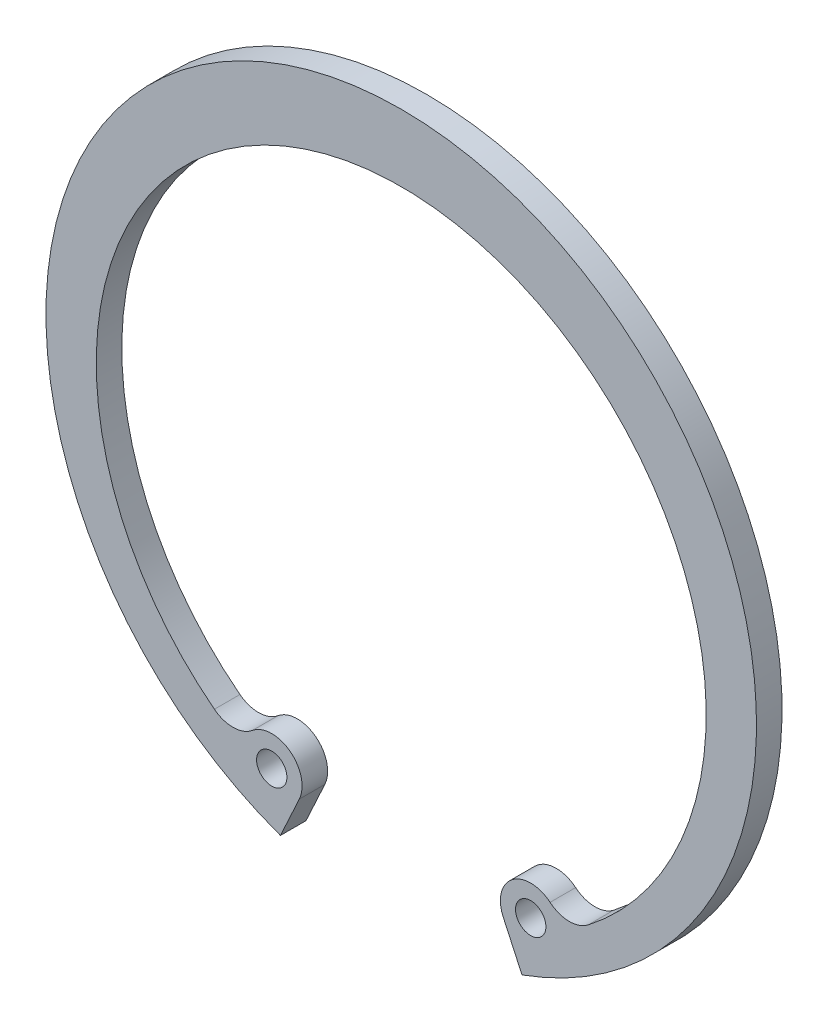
ISO-10303-21;
HEADER;
FILE_DESCRIPTION(('STEP AP214'),'2;1');
FILE_NAME('part.step','',(''),(''),'','','');
FILE_SCHEMA(('AUTOMOTIVE_DESIGN { 1 0 10303 214 1 1 1 1 }'));
ENDSEC;
DATA;
#1=APPLICATION_CONTEXT('core data for automotive mechanical design processes');
#2=APPLICATION_PROTOCOL_DEFINITION('international standard','automotive_design',2000,#1);
#3=PRODUCT_CONTEXT('',#1,'mechanical');
#4=PRODUCT('Part','Part','',(#3));
#5=PRODUCT_RELATED_PRODUCT_CATEGORY('part','',(#4));
#6=PRODUCT_DEFINITION_FORMATION('','',#4);
#7=PRODUCT_DEFINITION_CONTEXT('part definition',#1,'design');
#8=PRODUCT_DEFINITION('design','',#6,#7);
#9=PRODUCT_DEFINITION_SHAPE('','',#8);
#10=(LENGTH_UNIT() NAMED_UNIT(*) SI_UNIT(.MILLI.,.METRE.));
#11=(NAMED_UNIT(*) PLANE_ANGLE_UNIT() SI_UNIT($,.RADIAN.));
#12=(NAMED_UNIT(*) SI_UNIT($,.STERADIAN.) SOLID_ANGLE_UNIT());
#13=UNCERTAINTY_MEASURE_WITH_UNIT(LENGTH_MEASURE(1.E-05),#10,'distance_accuracy_value','');
#14=(GEOMETRIC_REPRESENTATION_CONTEXT(3) GLOBAL_UNCERTAINTY_ASSIGNED_CONTEXT((#13)) GLOBAL_UNIT_ASSIGNED_CONTEXT((#10,
#11,#12)) REPRESENTATION_CONTEXT('',''));
#15=CARTESIAN_POINT('',(0.,0.,0.));
#16=DIRECTION('',(0.,0.,1.));
#17=DIRECTION('',(1.,0.,0.));
#18=AXIS2_PLACEMENT_3D('',#15,#16,#17);
#19=CARTESIAN_POINT('',(-0.048388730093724,-19.9071120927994,0.));
#20=DIRECTION('',(0.,0.,1.));
#21=DIRECTION('',(1.,0.,0.));
#22=AXIS2_PLACEMENT_3D('',#19,#20,#21);
#23=PLANE('',#22);
#24=CARTESIAN_POINT('',(-8.10888999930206,-37.5689613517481,0.));
#25=DIRECTION('',(0.,0.,1.));
#26=DIRECTION('',(1.,0.,0.));
#27=AXIS2_PLACEMENT_3D('',#24,#25,#26);
#28=CIRCLE('',#27,0.95);
#29=CARTESIAN_POINT('',(-7.15888999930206,-37.5689613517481,0.));
#30=VERTEX_POINT('',#29);
#31=EDGE_CURVE('E130',#30,#30,#28,.T.);
#32=ORIENTED_EDGE('',*,*,#31,.T.);
#33=EDGE_LOOP('',(#32));
#34=FACE_BOUND('',#33,.T.);
#35=CARTESIAN_POINT('',(8.10888999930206,-37.5689613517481,0.));
#36=DIRECTION('',(0.,0.,1.));
#37=DIRECTION('',(1.,0.,0.));
#38=AXIS2_PLACEMENT_3D('',#35,#36,#37);
#39=CIRCLE('',#38,0.95);
#40=CARTESIAN_POINT('',(9.05888999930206,-37.5689613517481,0.));
#41=VERTEX_POINT('',#40);
#42=EDGE_CURVE('E133',#41,#41,#39,.T.);
#43=ORIENTED_EDGE('',*,*,#42,.T.);
#44=EDGE_LOOP('',(#43));
#45=FACE_BOUND('',#44,.T.);
#46=CARTESIAN_POINT('',(-10.536154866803,-34.6451991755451,0.));
#47=DIRECTION('',(0.,0.,1.));
#48=DIRECTION('',(1.,0.,0.));
#49=AXIS2_PLACEMENT_3D('',#46,#47,#48);
#50=CIRCLE('',#49,1.9);
#51=CARTESIAN_POINT('',(-11.7000324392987,-36.1469944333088,0.));
#52=VERTEX_POINT('',#51);
#53=CARTESIAN_POINT('',(-9.32252243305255,-36.1070802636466,0.));
#54=VERTEX_POINT('',#53);
#55=EDGE_CURVE('E136',#52,#54,#50,.T.);
#56=ORIENTED_EDGE('',*,*,#55,.T.);
#57=CARTESIAN_POINT('',(-8.10888999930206,-37.5689613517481,0.));
#58=DIRECTION('',(0.,0.,1.));
#59=DIRECTION('',(1.,0.,0.));
#60=AXIS2_PLACEMENT_3D('',#57,#58,#59);
#61=CIRCLE('',#60,1.9);
#62=CARTESIAN_POINT('',(-6.38377234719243,-38.3651831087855,0.));
#63=VERTEX_POINT('',#62);
#64=EDGE_CURVE('E138',#63,#54,#61,.T.);
#65=ORIENTED_EDGE('',*,*,#64,.F.);
#66=DIRECTION('',(0.419064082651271,0.90795665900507,0.));
#67=VECTOR('',#66,1.);
#68=CARTESIAN_POINT('',(-6.38377234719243,-38.3651831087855,0.));
#69=LINE('',#68,#67);
#70=CARTESIAN_POINT('',(-7.565,-40.9244659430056,0.));
#71=VERTEX_POINT('',#70);
#72=EDGE_CURVE('E103',#71,#63,#69,.T.);
#73=ORIENTED_EDGE('',*,*,#72,.F.);
#74=CARTESIAN_POINT('',(0.,-20.,0.));
#75=DIRECTION('',(0.,0.,1.));
#76=DIRECTION('',(1.,0.,0.));
#77=AXIS2_PLACEMENT_3D('',#74,#75,#76);
#78=CIRCLE('',#77,22.25);
#79=CARTESIAN_POINT('',(7.565,-40.9244659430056,0.));
#80=VERTEX_POINT('',#79);
#81=EDGE_CURVE('E140',#80,#71,#78,.T.);
#82=ORIENTED_EDGE('',*,*,#81,.F.);
#83=DIRECTION('',(0.419064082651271,-0.90795665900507,0.));
#84=VECTOR('',#83,1.);
#85=CARTESIAN_POINT('',(7.565,-40.9244659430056,0.));
#86=LINE('',#85,#84);
#87=CARTESIAN_POINT('',(6.38377234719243,-38.3651831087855,0.));
#88=VERTEX_POINT('',#87);
#89=EDGE_CURVE('E107',#88,#80,#86,.T.);
#90=ORIENTED_EDGE('',*,*,#89,.F.);
#91=CARTESIAN_POINT('',(8.10888999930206,-37.5689613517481,0.));
#92=DIRECTION('',(0.,0.,1.));
#93=DIRECTION('',(1.,0.,0.));
#94=AXIS2_PLACEMENT_3D('',#91,#92,#93);
#95=CIRCLE('',#94,1.9);
#96=CARTESIAN_POINT('',(9.32252243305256,-36.1070802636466,0.));
#97=VERTEX_POINT('',#96);
#98=EDGE_CURVE('E83',#97,#88,#95,.T.);
#99=ORIENTED_EDGE('',*,*,#98,.F.);
#100=CARTESIAN_POINT('',(10.536154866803,-34.6451991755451,0.));
#101=DIRECTION('',(0.,0.,1.));
#102=DIRECTION('',(1.,0.,0.));
#103=AXIS2_PLACEMENT_3D('',#100,#101,#102);
#104=CIRCLE('',#103,1.9);
#105=CARTESIAN_POINT('',(11.7000324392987,-36.1469944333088,0.));
#106=VERTEX_POINT('',#105);
#107=EDGE_CURVE('E79',#97,#106,#104,.T.);
#108=ORIENTED_EDGE('',*,*,#107,.T.);
#109=CARTESIAN_POINT('',(0.,-21.05,0.));
#110=DIRECTION('',(0.,0.,1.));
#111=DIRECTION('',(1.,0.,0.));
#112=AXIS2_PLACEMENT_3D('',#109,#110,#111);
#113=CIRCLE('',#112,19.1);
#114=EDGE_CURVE('E19',#106,#52,#113,.T.);
#115=ORIENTED_EDGE('',*,*,#114,.T.);
#116=EDGE_LOOP('',(#56,#65,#73,#82,#90,#99,#108,#115));
#117=FACE_BOUND('',#116,.T.);
#118=ADVANCED_FACE('F16',(#34,#45,#117),#23,.F.);
#119=CARTESIAN_POINT('',(0.,-21.05,0.));
#120=DIRECTION('',(0.,0.,1.));
#121=DIRECTION('',(1.,0.,0.));
#122=AXIS2_PLACEMENT_3D('',#119,#120,#121);
#123=CYLINDRICAL_SURFACE('',#122,19.1);
#124=DIRECTION('',(0.,0.,1.));
#125=VECTOR('',#124,1.);
#126=CARTESIAN_POINT('',(-11.7000324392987,-36.1469944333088,0.));
#127=LINE('',#126,#125);
#128=CARTESIAN_POINT('',(-11.7000324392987,-36.1469944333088,1.6));
#129=VERTEX_POINT('',#128);
#130=EDGE_CURVE('E92',#129,#52,#127,.F.);
#131=ORIENTED_EDGE('',*,*,#130,.T.);
#132=ORIENTED_EDGE('',*,*,#114,.F.);
#133=DIRECTION('',(0.,0.,1.));
#134=VECTOR('',#133,1.);
#135=CARTESIAN_POINT('',(11.7000324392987,-36.1469944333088,0.));
#136=LINE('',#135,#134);
#137=CARTESIAN_POINT('',(11.7000324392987,-36.1469944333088,1.6));
#138=VERTEX_POINT('',#137);
#139=EDGE_CURVE('E87',#106,#138,#136,.T.);
#140=ORIENTED_EDGE('',*,*,#139,.T.);
#141=CARTESIAN_POINT('',(0.,-21.05,1.6));
#142=DIRECTION('',(0.,0.,1.));
#143=DIRECTION('',(1.,0.,0.));
#144=AXIS2_PLACEMENT_3D('',#141,#142,#143);
#145=CIRCLE('',#144,19.1);
#146=EDGE_CURVE('E128',#129,#138,#145,.F.);
#147=ORIENTED_EDGE('',*,*,#146,.F.);
#148=EDGE_LOOP('',(#131,#132,#140,#147));
#149=FACE_BOUND('',#148,.T.);
#150=ADVANCED_FACE('F89',(#149),#123,.F.);
#151=CARTESIAN_POINT('',(10.536154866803,-34.6451991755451,0.));
#152=DIRECTION('',(0.,0.,1.));
#153=DIRECTION('',(1.,0.,0.));
#154=AXIS2_PLACEMENT_3D('',#151,#152,#153);
#155=CYLINDRICAL_SURFACE('',#154,1.9);
#156=ORIENTED_EDGE('',*,*,#139,.F.);
#157=ORIENTED_EDGE('',*,*,#107,.F.);
#158=DIRECTION('',(0.,0.,1.));
#159=VECTOR('',#158,1.);
#160=CARTESIAN_POINT('',(9.32252243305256,-36.1070802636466,0.));
#161=LINE('',#160,#159);
#162=CARTESIAN_POINT('',(9.32252243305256,-36.1070802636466,1.6));
#163=VERTEX_POINT('',#162);
#164=EDGE_CURVE('E98',#163,#97,#161,.F.);
#165=ORIENTED_EDGE('',*,*,#164,.F.);
#166=CARTESIAN_POINT('',(10.536154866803,-34.6451991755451,1.6));
#167=DIRECTION('',(0.,0.,1.));
#168=DIRECTION('',(1.,0.,0.));
#169=AXIS2_PLACEMENT_3D('',#166,#167,#168);
#170=CIRCLE('',#169,1.9);
#171=EDGE_CURVE('E96',#138,#163,#170,.F.);
#172=ORIENTED_EDGE('',*,*,#171,.F.);
#173=EDGE_LOOP('',(#156,#157,#165,#172));
#174=FACE_BOUND('',#173,.T.);
#175=ADVANCED_FACE('F94',(#174),#155,.F.);
#176=CARTESIAN_POINT('',(8.10888999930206,-37.5689613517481,0.));
#177=DIRECTION('',(0.,0.,1.));
#178=DIRECTION('',(1.,0.,0.));
#179=AXIS2_PLACEMENT_3D('',#176,#177,#178);
#180=CYLINDRICAL_SURFACE('',#179,1.9);
#181=ORIENTED_EDGE('',*,*,#98,.T.);
#182=DIRECTION('',(0.,0.,1.));
#183=VECTOR('',#182,1.);
#184=CARTESIAN_POINT('',(6.38377234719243,-38.3651831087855,0.));
#185=LINE('',#184,#183);
#186=CARTESIAN_POINT('',(6.38377234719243,-38.3651831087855,1.6));
#187=VERTEX_POINT('',#186);
#188=EDGE_CURVE('E109',#187,#88,#185,.F.);
#189=ORIENTED_EDGE('',*,*,#188,.F.);
#190=CARTESIAN_POINT('',(8.10888999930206,-37.5689613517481,1.6));
#191=DIRECTION('',(0.,0.,1.));
#192=DIRECTION('',(1.,0.,0.));
#193=AXIS2_PLACEMENT_3D('',#190,#191,#192);
#194=CIRCLE('',#193,1.9);
#195=EDGE_CURVE('E124',#163,#187,#194,.T.);
#196=ORIENTED_EDGE('',*,*,#195,.F.);
#197=ORIENTED_EDGE('',*,*,#164,.T.);
#198=EDGE_LOOP('',(#181,#189,#196,#197));
#199=FACE_BOUND('',#198,.T.);
#200=ADVANCED_FACE('F210',(#199),#180,.T.);
#201=CARTESIAN_POINT('',(7.565,-40.9244659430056,0.));
#202=DIRECTION('',(-0.90795665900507,-0.419064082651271,0.));
#203=DIRECTION('',(0.419064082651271,-0.90795665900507,0.));
#204=AXIS2_PLACEMENT_3D('',#201,#202,#203);
#205=PLANE('',#204);
#206=ORIENTED_EDGE('',*,*,#89,.T.);
#207=DIRECTION('',(0.,0.,1.));
#208=VECTOR('',#207,1.);
#209=CARTESIAN_POINT('',(7.565,-40.9244659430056,0.));
#210=LINE('',#209,#208);
#211=CARTESIAN_POINT('',(7.565,-40.9244659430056,1.6));
#212=VERTEX_POINT('',#211);
#213=EDGE_CURVE('E108',#212,#80,#210,.F.);
#214=ORIENTED_EDGE('',*,*,#213,.F.);
#215=DIRECTION('',(0.419064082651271,-0.90795665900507,0.));
#216=VECTOR('',#215,1.);
#217=CARTESIAN_POINT('',(6.38377234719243,-38.3651831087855,1.6));
#218=LINE('',#217,#216);
#219=EDGE_CURVE('E123',#187,#212,#218,.T.);
#220=ORIENTED_EDGE('',*,*,#219,.F.);
#221=ORIENTED_EDGE('',*,*,#188,.T.);
#222=EDGE_LOOP('',(#206,#214,#220,#221));
#223=FACE_BOUND('',#222,.T.);
#224=ADVANCED_FACE('F215',(#223),#205,.T.);
#225=CARTESIAN_POINT('',(0.,-20.,0.));
#226=DIRECTION('',(0.,0.,1.));
#227=DIRECTION('',(1.,0.,0.));
#228=AXIS2_PLACEMENT_3D('',#225,#226,#227);
#229=CYLINDRICAL_SURFACE('',#228,22.25);
#230=ORIENTED_EDGE('',*,*,#81,.T.);
#231=DIRECTION('',(0.,0.,1.));
#232=VECTOR('',#231,1.);
#233=CARTESIAN_POINT('',(-7.565,-40.9244659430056,0.));
#234=LINE('',#233,#232);
#235=CARTESIAN_POINT('',(-7.565,-40.9244659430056,1.6));
#236=VERTEX_POINT('',#235);
#237=EDGE_CURVE('E106',#236,#71,#234,.F.);
#238=ORIENTED_EDGE('',*,*,#237,.F.);
#239=CARTESIAN_POINT('',(0.,-20.,1.6));
#240=DIRECTION('',(0.,0.,1.));
#241=DIRECTION('',(1.,0.,0.));
#242=AXIS2_PLACEMENT_3D('',#239,#240,#241);
#243=CIRCLE('',#242,22.25);
#244=EDGE_CURVE('E120',#212,#236,#243,.T.);
#245=ORIENTED_EDGE('',*,*,#244,.F.);
#246=ORIENTED_EDGE('',*,*,#213,.T.);
#247=EDGE_LOOP('',(#230,#238,#245,#246));
#248=FACE_BOUND('',#247,.T.);
#249=ADVANCED_FACE('F178',(#248),#229,.T.);
#250=CARTESIAN_POINT('',(-6.38377234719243,-38.3651831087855,0.));
#251=DIRECTION('',(0.90795665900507,-0.419064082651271,0.));
#252=DIRECTION('',(0.419064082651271,0.90795665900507,0.));
#253=AXIS2_PLACEMENT_3D('',#250,#251,#252);
#254=PLANE('',#253);
#255=ORIENTED_EDGE('',*,*,#72,.T.);
#256=DIRECTION('',(0.,0.,1.));
#257=VECTOR('',#256,1.);
#258=CARTESIAN_POINT('',(-6.38377234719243,-38.3651831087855,0.));
#259=LINE('',#258,#257);
#260=CARTESIAN_POINT('',(-6.38377234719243,-38.3651831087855,1.6));
#261=VERTEX_POINT('',#260);
#262=EDGE_CURVE('E105',#261,#63,#259,.F.);
#263=ORIENTED_EDGE('',*,*,#262,.F.);
#264=DIRECTION('',(0.419064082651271,0.90795665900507,0.));
#265=VECTOR('',#264,1.);
#266=CARTESIAN_POINT('',(-7.565,-40.9244659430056,1.6));
#267=LINE('',#266,#265);
#268=EDGE_CURVE('E119',#236,#261,#267,.T.);
#269=ORIENTED_EDGE('',*,*,#268,.F.);
#270=ORIENTED_EDGE('',*,*,#237,.T.);
#271=EDGE_LOOP('',(#255,#263,#269,#270));
#272=FACE_BOUND('',#271,.T.);
#273=ADVANCED_FACE('F163',(#272),#254,.T.);
#274=CARTESIAN_POINT('',(-8.10888999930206,-37.5689613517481,0.));
#275=DIRECTION('',(0.,0.,1.));
#276=DIRECTION('',(1.,0.,0.));
#277=AXIS2_PLACEMENT_3D('',#274,#275,#276);
#278=CYLINDRICAL_SURFACE('',#277,1.9);
#279=ORIENTED_EDGE('',*,*,#64,.T.);
#280=DIRECTION('',(0.,0.,1.));
#281=VECTOR('',#280,1.);
#282=CARTESIAN_POINT('',(-9.32252243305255,-36.1070802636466,0.));
#283=LINE('',#282,#281);
#284=CARTESIAN_POINT('',(-9.32252243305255,-36.1070802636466,1.6));
#285=VERTEX_POINT('',#284);
#286=EDGE_CURVE('E34',#54,#285,#283,.T.);
#287=ORIENTED_EDGE('',*,*,#286,.T.);
#288=CARTESIAN_POINT('',(-8.10888999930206,-37.5689613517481,1.6));
#289=DIRECTION('',(0.,0.,1.));
#290=DIRECTION('',(1.,0.,0.));
#291=AXIS2_PLACEMENT_3D('',#288,#289,#290);
#292=CIRCLE('',#291,1.9);
#293=EDGE_CURVE('E116',#261,#285,#292,.T.);
#294=ORIENTED_EDGE('',*,*,#293,.F.);
#295=ORIENTED_EDGE('',*,*,#262,.T.);
#296=EDGE_LOOP('',(#279,#287,#294,#295));
#297=FACE_BOUND('',#296,.T.);
#298=ADVANCED_FACE('F166',(#297),#278,.T.);
#299=CARTESIAN_POINT('',(-10.536154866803,-34.6451991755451,0.));
#300=DIRECTION('',(0.,0.,1.));
#301=DIRECTION('',(1.,0.,0.));
#302=AXIS2_PLACEMENT_3D('',#299,#300,#301);
#303=CYLINDRICAL_SURFACE('',#302,1.9);
#304=ORIENTED_EDGE('',*,*,#286,.F.);
#305=ORIENTED_EDGE('',*,*,#55,.F.);
#306=ORIENTED_EDGE('',*,*,#130,.F.);
#307=CARTESIAN_POINT('',(-10.536154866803,-34.6451991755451,1.6));
#308=DIRECTION('',(0.,0.,1.));
#309=DIRECTION('',(1.,0.,0.));
#310=AXIS2_PLACEMENT_3D('',#307,#308,#309);
#311=CIRCLE('',#310,1.9);
#312=EDGE_CURVE('E113',#285,#129,#311,.F.);
#313=ORIENTED_EDGE('',*,*,#312,.F.);
#314=EDGE_LOOP('',(#304,#305,#306,#313));
#315=FACE_BOUND('',#314,.T.);
#316=ADVANCED_FACE('F168',(#315),#303,.F.);
#317=CARTESIAN_POINT('',(8.10888999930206,-37.5689613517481,0.));
#318=DIRECTION('',(0.,0.,1.));
#319=DIRECTION('',(1.,0.,0.));
#320=AXIS2_PLACEMENT_3D('',#317,#318,#319);
#321=CYLINDRICAL_SURFACE('',#320,0.95);
#322=ORIENTED_EDGE('',*,*,#42,.F.);
#323=EDGE_LOOP('',(#322));
#324=FACE_BOUND('',#323,.T.);
#325=CARTESIAN_POINT('',(8.10888999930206,-37.5689613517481,1.6));
#326=DIRECTION('',(0.,0.,1.));
#327=DIRECTION('',(1.,0.,0.));
#328=AXIS2_PLACEMENT_3D('',#325,#326,#327);
#329=CIRCLE('',#328,0.95);
#330=CARTESIAN_POINT('',(9.05888999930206,-37.5689613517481,1.6));
#331=VERTEX_POINT('',#330);
#332=EDGE_CURVE('E25',#331,#331,#329,.F.);
#333=ORIENTED_EDGE('',*,*,#332,.F.);
#334=EDGE_LOOP('',(#333));
#335=FACE_BOUND('',#334,.T.);
#336=ADVANCED_FACE('F175',(#324,#335),#321,.F.);
#337=CARTESIAN_POINT('',(-8.10888999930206,-37.5689613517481,0.));
#338=DIRECTION('',(0.,0.,1.));
#339=DIRECTION('',(1.,0.,0.));
#340=AXIS2_PLACEMENT_3D('',#337,#338,#339);
#341=CYLINDRICAL_SURFACE('',#340,0.95);
#342=ORIENTED_EDGE('',*,*,#31,.F.);
#343=EDGE_LOOP('',(#342));
#344=FACE_BOUND('',#343,.T.);
#345=CARTESIAN_POINT('',(-8.10888999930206,-37.5689613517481,1.6));
#346=DIRECTION('',(0.,0.,1.));
#347=DIRECTION('',(1.,0.,0.));
#348=AXIS2_PLACEMENT_3D('',#345,#346,#347);
#349=CIRCLE('',#348,0.95);
#350=CARTESIAN_POINT('',(-7.15888999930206,-37.5689613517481,1.6));
#351=VERTEX_POINT('',#350);
#352=EDGE_CURVE('E10',#351,#351,#349,.F.);
#353=ORIENTED_EDGE('',*,*,#352,.F.);
#354=EDGE_LOOP('',(#353));
#355=FACE_BOUND('',#354,.T.);
#356=ADVANCED_FACE('F181',(#344,#355),#341,.F.);
#357=CARTESIAN_POINT('',(-0.048388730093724,-19.9071120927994,1.6));
#358=DIRECTION('',(0.,0.,1.));
#359=DIRECTION('',(1.,0.,0.));
#360=AXIS2_PLACEMENT_3D('',#357,#358,#359);
#361=PLANE('',#360);
#362=ORIENTED_EDGE('',*,*,#352,.T.);
#363=EDGE_LOOP('',(#362));
#364=FACE_BOUND('',#363,.T.);
#365=ORIENTED_EDGE('',*,*,#332,.T.);
#366=EDGE_LOOP('',(#365));
#367=FACE_BOUND('',#366,.T.);
#368=ORIENTED_EDGE('',*,*,#293,.T.);
#369=ORIENTED_EDGE('',*,*,#312,.T.);
#370=ORIENTED_EDGE('',*,*,#146,.T.);
#371=ORIENTED_EDGE('',*,*,#171,.T.);
#372=ORIENTED_EDGE('',*,*,#195,.T.);
#373=ORIENTED_EDGE('',*,*,#219,.T.);
#374=ORIENTED_EDGE('',*,*,#244,.T.);
#375=ORIENTED_EDGE('',*,*,#268,.T.);
#376=EDGE_LOOP('',(#368,#369,#370,#371,#372,#373,#374,#375));
#377=FACE_BOUND('',#376,.T.);
#378=ADVANCED_FACE('F160',(#364,#367,#377),#361,.T.);
#379=CLOSED_SHELL('',(#118,#150,#175,#200,#224,#249,#273,#298,#316,#336,#356,#378));
#380=MANIFOLD_SOLID_BREP('B1',#379);
#381=ADVANCED_BREP_SHAPE_REPRESENTATION('',(#18,#380),#14);
#382=SHAPE_DEFINITION_REPRESENTATION(#9,#381);
ENDSEC;
END-ISO-10303-21;
